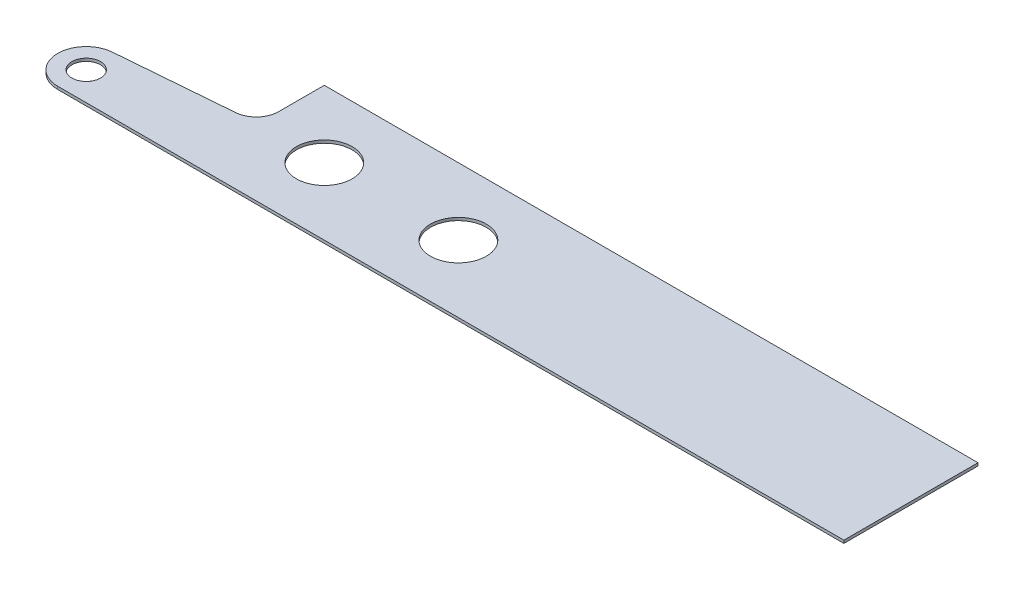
ISO-10303-21;
HEADER;
FILE_DESCRIPTION(('STEP AP214'),'2;1');
FILE_NAME('part.step','',(''),(''),'','','');
FILE_SCHEMA(('AUTOMOTIVE_DESIGN { 1 0 10303 214 1 1 1 1 }'));
ENDSEC;
DATA;
#1=APPLICATION_CONTEXT('core data for automotive mechanical design processes');
#2=APPLICATION_PROTOCOL_DEFINITION('international standard','automotive_design',2000,#1);
#3=PRODUCT_CONTEXT('',#1,'mechanical');
#4=PRODUCT('Part','Part','',(#3));
#5=PRODUCT_RELATED_PRODUCT_CATEGORY('part','',(#4));
#6=PRODUCT_DEFINITION_FORMATION('','',#4);
#7=PRODUCT_DEFINITION_CONTEXT('part definition',#1,'design');
#8=PRODUCT_DEFINITION('design','',#6,#7);
#9=PRODUCT_DEFINITION_SHAPE('','',#8);
#10=(LENGTH_UNIT() NAMED_UNIT(*) SI_UNIT(.MILLI.,.METRE.));
#11=(NAMED_UNIT(*) PLANE_ANGLE_UNIT() SI_UNIT($,.RADIAN.));
#12=(NAMED_UNIT(*) SI_UNIT($,.STERADIAN.) SOLID_ANGLE_UNIT());
#13=UNCERTAINTY_MEASURE_WITH_UNIT(LENGTH_MEASURE(1.E-05),#10,'distance_accuracy_value','');
#14=(GEOMETRIC_REPRESENTATION_CONTEXT(3) GLOBAL_UNCERTAINTY_ASSIGNED_CONTEXT((#13)) GLOBAL_UNIT_ASSIGNED_CONTEXT((#10,
#11,#12)) REPRESENTATION_CONTEXT('',''));
#15=CARTESIAN_POINT('',(0.,0.,0.));
#16=DIRECTION('',(0.,0.,1.));
#17=DIRECTION('',(1.,0.,0.));
#18=AXIS2_PLACEMENT_3D('',#15,#16,#17);
#19=CARTESIAN_POINT('',(0.,0.,0.));
#20=DIRECTION('',(0.,-1.,0.));
#21=DIRECTION('',(0.,0.,-1.));
#22=AXIS2_PLACEMENT_3D('',#19,#20,#21);
#23=PLANE('',#22);
#24=CARTESIAN_POINT('',(4.7625,0.,0.));
#25=DIRECTION('',(0.,1.,0.));
#26=DIRECTION('',(0.,0.,-1.));
#27=AXIS2_PLACEMENT_3D('',#24,#25,#26);
#28=CIRCLE('',#27,1.9812);
#29=CARTESIAN_POINT('',(4.7625,0.,-1.9812));
#30=VERTEX_POINT('',#29);
#31=EDGE_CURVE('E191',#30,#30,#28,.T.);
#32=ORIENTED_EDGE('',*,*,#31,.T.);
#33=EDGE_LOOP('',(#32));
#34=FACE_BOUND('',#33,.T.);
#35=DIRECTION('',(-1.,0.,0.));
#36=VECTOR('',#35,1.);
#37=CARTESIAN_POINT('',(-9.525,0.,-4.7625));
#38=LINE('',#37,#36);
#39=CARTESIAN_POINT('',(36.9062,0.,-4.7625));
#40=VERTEX_POINT('',#39);
#41=CARTESIAN_POINT('',(-9.525,0.,-4.7625));
#42=VERTEX_POINT('',#41);
#43=EDGE_CURVE('E207',#40,#42,#38,.T.);
#44=ORIENTED_EDGE('',*,*,#43,.F.);
#45=DIRECTION('',(0.,0.,-1.));
#46=VECTOR('',#45,1.);
#47=CARTESIAN_POINT('',(36.9062,0.,-4.7625));
#48=LINE('',#47,#46);
#49=CARTESIAN_POINT('',(36.9062,0.,4.7625));
#50=VERTEX_POINT('',#49);
#51=EDGE_CURVE('E152',#50,#40,#48,.T.);
#52=ORIENTED_EDGE('',*,*,#51,.F.);
#53=DIRECTION('',(1.,0.,0.));
#54=VECTOR('',#53,1.);
#55=CARTESIAN_POINT('',(-9.525,0.,4.7625));
#56=LINE('',#55,#54);
#57=CARTESIAN_POINT('',(-18.9323658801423,0.,4.7625));
#58=VERTEX_POINT('',#57);
#59=EDGE_CURVE('E213',#58,#50,#56,.T.);
#60=ORIENTED_EDGE('',*,*,#59,.F.);
#61=CARTESIAN_POINT('',(-18.9323658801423,0.,2.73986588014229));
#62=DIRECTION('',(0.,1.,0.));
#63=DIRECTION('',(0.,0.,-1.));
#64=AXIS2_PLACEMENT_3D('',#61,#62,#63);
#65=CIRCLE('',#64,2.02263411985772);
#66=CARTESIAN_POINT('',(-19.0964705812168,0.,0.723900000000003));
#67=VERTEX_POINT('',#66);
#68=EDGE_CURVE('E177',#67,#58,#65,.T.);
#69=ORIENTED_EDGE('',*,*,#68,.F.);
#70=DIRECTION('',(-0.996703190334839,0.,0.0811341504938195));
#71=VECTOR('',#70,1.);
#72=CARTESIAN_POINT('',(-19.0964705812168,0.,0.723900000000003));
#73=LINE('',#72,#71);
#74=CARTESIAN_POINT('',(-10.9836995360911,0.,0.0635000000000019));
#75=VERTEX_POINT('',#74);
#76=EDGE_CURVE('E173',#75,#67,#73,.T.);
#77=ORIENTED_EDGE('',*,*,#76,.F.);
#78=CARTESIAN_POINT('',(-11.1125,0.,-1.51876631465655));
#79=DIRECTION('',(0.,-1.,0.));
#80=DIRECTION('',(0.,0.,1.));
#81=AXIS2_PLACEMENT_3D('',#78,#79,#80);
#82=CIRCLE('',#81,1.5875);
#83=CARTESIAN_POINT('',(-9.525,0.,-1.51876631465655));
#84=VERTEX_POINT('',#83);
#85=EDGE_CURVE('E170',#84,#75,#82,.T.);
#86=ORIENTED_EDGE('',*,*,#85,.F.);
#87=DIRECTION('',(0.,0.,1.));
#88=VECTOR('',#87,1.);
#89=CARTESIAN_POINT('',(-9.525,0.,4.7625));
#90=LINE('',#89,#88);
#91=EDGE_CURVE('E220',#42,#84,#90,.T.);
#92=ORIENTED_EDGE('',*,*,#91,.F.);
#93=EDGE_LOOP('',(#44,#52,#60,#69,#77,#86,#92));
#94=FACE_BOUND('',#93,.T.);
#95=CARTESIAN_POINT('',(-4.7625,0.,0.));
#96=DIRECTION('',(0.,1.,0.));
#97=DIRECTION('',(0.,0.,1.));
#98=AXIS2_PLACEMENT_3D('',#95,#96,#97);
#99=CIRCLE('',#98,1.9812);
#100=CARTESIAN_POINT('',(-4.7625,0.,1.9812));
#101=VERTEX_POINT('',#100);
#102=EDGE_CURVE('E201',#101,#101,#99,.T.);
#103=ORIENTED_EDGE('',*,*,#102,.T.);
#104=EDGE_LOOP('',(#103));
#105=FACE_BOUND('',#104,.T.);
#106=CARTESIAN_POINT('',(-18.9323658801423,0.,2.73986588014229));
#107=DIRECTION('',(0.,1.,0.));
#108=DIRECTION('',(0.,0.,1.));
#109=AXIS2_PLACEMENT_3D('',#106,#107,#108);
#110=CIRCLE('',#109,1.016);
#111=CARTESIAN_POINT('',(-18.9323658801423,0.,3.75586588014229));
#112=VERTEX_POINT('',#111);
#113=EDGE_CURVE('E164',#112,#112,#110,.T.);
#114=ORIENTED_EDGE('',*,*,#113,.T.);
#115=EDGE_LOOP('',(#114));
#116=FACE_BOUND('',#115,.T.);
#117=DIRECTION('',(-0.707106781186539,0.,0.707106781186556));
#118=VECTOR('',#117,1.);
#119=CARTESIAN_POINT('',(33.7773323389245,0.,-1.14947278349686));
#120=LINE('',#119,#118);
#121=CARTESIAN_POINT('',(33.7773323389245,0.,-1.14947278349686));
#122=VERTEX_POINT('',#121);
#123=CARTESIAN_POINT('',(33.5977272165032,0.,-0.969867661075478));
#124=VERTEX_POINT('',#123);
#125=EDGE_CURVE('E138',#122,#124,#120,.T.);
#126=ORIENTED_EDGE('',*,*,#125,.T.);
#127=DIRECTION('',(-0.707106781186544,0.,-0.707106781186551));
#128=VECTOR('',#127,1.);
#129=CARTESIAN_POINT('',(35.7170676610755,0.,1.14947278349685));
#130=LINE('',#129,#128);
#131=CARTESIAN_POINT('',(35.7170676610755,0.,1.14947278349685));
#132=VERTEX_POINT('',#131);
#133=EDGE_CURVE('E125',#132,#124,#130,.T.);
#134=ORIENTED_EDGE('',*,*,#133,.F.);
#135=DIRECTION('',(0.707106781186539,0.,-0.707106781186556));
#136=VECTOR('',#135,1.);
#137=CARTESIAN_POINT('',(35.7170676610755,0.,1.14947278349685));
#138=LINE('',#137,#136);
#139=CARTESIAN_POINT('',(35.8966727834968,0.,0.969867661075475));
#140=VERTEX_POINT('',#139);
#141=EDGE_CURVE('E130',#132,#140,#138,.T.);
#142=ORIENTED_EDGE('',*,*,#141,.T.);
#143=DIRECTION('',(-0.707106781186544,0.,-0.707106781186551));
#144=VECTOR('',#143,1.);
#145=CARTESIAN_POINT('',(35.8966727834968,0.,0.969867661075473));
#146=LINE('',#145,#144);
#147=EDGE_CURVE('E141',#140,#122,#146,.T.);
#148=ORIENTED_EDGE('',*,*,#147,.T.);
#149=EDGE_LOOP('',(#126,#134,#142,#148));
#150=FACE_BOUND('',#149,.T.);
#151=ADVANCED_FACE('F35',(#34,#94,#105,#116,#150),#23,.T.);
#152=CARTESIAN_POINT('',(-9.525,0.2032,4.7625));
#153=DIRECTION('',(1.,0.,0.));
#154=DIRECTION('',(0.,0.,-1.));
#155=AXIS2_PLACEMENT_3D('',#152,#153,#154);
#156=PLANE('',#155);
#157=DIRECTION('',(0.,1.,0.));
#158=VECTOR('',#157,1.);
#159=CARTESIAN_POINT('',(-9.525,0.,-1.51876631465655));
#160=LINE('',#159,#158);
#161=CARTESIAN_POINT('',(-9.525,0.2032,-1.51876631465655));
#162=VERTEX_POINT('',#161);
#163=EDGE_CURVE('E180',#84,#162,#160,.T.);
#164=ORIENTED_EDGE('',*,*,#163,.T.);
#165=DIRECTION('',(0.,0.,1.));
#166=VECTOR('',#165,1.);
#167=CARTESIAN_POINT('',(-9.525,0.2032,4.7625));
#168=LINE('',#167,#166);
#169=CARTESIAN_POINT('',(-9.525,0.2032,-4.7625));
#170=VERTEX_POINT('',#169);
#171=EDGE_CURVE('E212',#170,#162,#168,.T.);
#172=ORIENTED_EDGE('',*,*,#171,.F.);
#173=DIRECTION('',(0.,-1.,0.));
#174=VECTOR('',#173,1.);
#175=CARTESIAN_POINT('',(-9.525,0.2032,-4.7625));
#176=LINE('',#175,#174);
#177=EDGE_CURVE('E218',#170,#42,#176,.T.);
#178=ORIENTED_EDGE('',*,*,#177,.T.);
#179=ORIENTED_EDGE('',*,*,#91,.T.);
#180=EDGE_LOOP('',(#164,#172,#178,#179));
#181=FACE_BOUND('',#180,.T.);
#182=ADVANCED_FACE('F254',(#181),#156,.F.);
#183=CARTESIAN_POINT('',(0.,0.2032,0.));
#184=DIRECTION('',(0.,-1.,0.));
#185=DIRECTION('',(0.,0.,-1.));
#186=AXIS2_PLACEMENT_3D('',#183,#184,#185);
#187=PLANE('',#186);
#188=CARTESIAN_POINT('',(-18.9323658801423,0.2032,2.73986588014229));
#189=DIRECTION('',(0.,1.,0.));
#190=DIRECTION('',(0.,0.,1.));
#191=AXIS2_PLACEMENT_3D('',#188,#189,#190);
#192=CIRCLE('',#191,1.016);
#193=CARTESIAN_POINT('',(-18.9323658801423,0.2032,3.75586588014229));
#194=VERTEX_POINT('',#193);
#195=EDGE_CURVE('E161',#194,#194,#192,.T.);
#196=ORIENTED_EDGE('',*,*,#195,.F.);
#197=EDGE_LOOP('',(#196));
#198=FACE_BOUND('',#197,.T.);
#199=CARTESIAN_POINT('',(-4.7625,0.2032,0.));
#200=DIRECTION('',(0.,1.,0.));
#201=DIRECTION('',(0.,0.,1.));
#202=AXIS2_PLACEMENT_3D('',#199,#200,#201);
#203=CIRCLE('',#202,1.9812);
#204=CARTESIAN_POINT('',(-4.7625,0.2032,1.9812));
#205=VERTEX_POINT('',#204);
#206=EDGE_CURVE('E204',#205,#205,#203,.T.);
#207=ORIENTED_EDGE('',*,*,#206,.F.);
#208=EDGE_LOOP('',(#207));
#209=FACE_BOUND('',#208,.T.);
#210=DIRECTION('',(1.,0.,0.));
#211=VECTOR('',#210,1.);
#212=CARTESIAN_POINT('',(-9.525,0.2032,4.7625));
#213=LINE('',#212,#211);
#214=CARTESIAN_POINT('',(-18.9323658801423,0.2032,4.7625));
#215=VERTEX_POINT('',#214);
#216=CARTESIAN_POINT('',(36.9062,0.2032,4.7625));
#217=VERTEX_POINT('',#216);
#218=EDGE_CURVE('E216',#215,#217,#213,.T.);
#219=ORIENTED_EDGE('',*,*,#218,.T.);
#220=DIRECTION('',(0.,0.,-1.));
#221=VECTOR('',#220,1.);
#222=CARTESIAN_POINT('',(36.9062,0.2032,-4.7625));
#223=LINE('',#222,#221);
#224=CARTESIAN_POINT('',(36.9062,0.2032,-4.7625));
#225=VERTEX_POINT('',#224);
#226=EDGE_CURVE('E151',#217,#225,#223,.T.);
#227=ORIENTED_EDGE('',*,*,#226,.T.);
#228=DIRECTION('',(-1.,0.,0.));
#229=VECTOR('',#228,1.);
#230=CARTESIAN_POINT('',(-9.525,0.2032,-4.7625));
#231=LINE('',#230,#229);
#232=EDGE_CURVE('E210',#225,#170,#231,.T.);
#233=ORIENTED_EDGE('',*,*,#232,.T.);
#234=ORIENTED_EDGE('',*,*,#171,.T.);
#235=CARTESIAN_POINT('',(-11.1125,0.2032,-1.51876631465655));
#236=DIRECTION('',(0.,-1.,0.));
#237=DIRECTION('',(0.,0.,1.));
#238=AXIS2_PLACEMENT_3D('',#235,#236,#237);
#239=CIRCLE('',#238,1.5875);
#240=CARTESIAN_POINT('',(-10.9836995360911,0.2032,0.0635000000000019));
#241=VERTEX_POINT('',#240);
#242=EDGE_CURVE('E167',#162,#241,#239,.T.);
#243=ORIENTED_EDGE('',*,*,#242,.T.);
#244=DIRECTION('',(-0.996703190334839,0.,0.0811341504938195));
#245=VECTOR('',#244,1.);
#246=CARTESIAN_POINT('',(-19.0964705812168,0.2032,0.723900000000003));
#247=LINE('',#246,#245);
#248=CARTESIAN_POINT('',(-19.0964705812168,0.2032,0.723900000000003));
#249=VERTEX_POINT('',#248);
#250=EDGE_CURVE('E183',#241,#249,#247,.T.);
#251=ORIENTED_EDGE('',*,*,#250,.T.);
#252=CARTESIAN_POINT('',(-18.9323658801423,0.2032,2.73986588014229));
#253=DIRECTION('',(0.,1.,0.));
#254=DIRECTION('',(0.,0.,-1.));
#255=AXIS2_PLACEMENT_3D('',#252,#253,#254);
#256=CIRCLE('',#255,2.02263411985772);
#257=EDGE_CURVE('E174',#249,#215,#256,.T.);
#258=ORIENTED_EDGE('',*,*,#257,.T.);
#259=EDGE_LOOP('',(#219,#227,#233,#234,#243,#251,#258));
#260=FACE_BOUND('',#259,.T.);
#261=CARTESIAN_POINT('',(4.7625,0.2032,0.));
#262=DIRECTION('',(0.,1.,0.));
#263=DIRECTION('',(0.,0.,-1.));
#264=AXIS2_PLACEMENT_3D('',#261,#262,#263);
#265=CIRCLE('',#264,1.9812);
#266=CARTESIAN_POINT('',(4.7625,0.2032,-1.9812));
#267=VERTEX_POINT('',#266);
#268=EDGE_CURVE('E198',#267,#267,#265,.T.);
#269=ORIENTED_EDGE('',*,*,#268,.F.);
#270=EDGE_LOOP('',(#269));
#271=FACE_BOUND('',#270,.T.);
#272=ADVANCED_FACE('F260',(#198,#209,#260,#271),#187,.F.);
#273=CARTESIAN_POINT('',(-9.525,0.2032,-4.7625));
#274=DIRECTION('',(0.,0.,1.));
#275=DIRECTION('',(1.,0.,0.));
#276=AXIS2_PLACEMENT_3D('',#273,#274,#275);
#277=PLANE('',#276);
#278=ORIENTED_EDGE('',*,*,#43,.T.);
#279=ORIENTED_EDGE('',*,*,#177,.F.);
#280=ORIENTED_EDGE('',*,*,#232,.F.);
#281=DIRECTION('',(0.,1.,0.));
#282=VECTOR('',#281,1.);
#283=CARTESIAN_POINT('',(36.9062,0.,-4.7625));
#284=LINE('',#283,#282);
#285=EDGE_CURVE('E158',#40,#225,#284,.T.);
#286=ORIENTED_EDGE('',*,*,#285,.F.);
#287=EDGE_LOOP('',(#278,#279,#280,#286));
#288=FACE_BOUND('',#287,.T.);
#289=ADVANCED_FACE('F270',(#288),#277,.F.);
#290=CARTESIAN_POINT('',(-9.525,0.2032,4.7625));
#291=DIRECTION('',(0.,0.,-1.));
#292=DIRECTION('',(-1.,0.,0.));
#293=AXIS2_PLACEMENT_3D('',#290,#291,#292);
#294=PLANE('',#293);
#295=ORIENTED_EDGE('',*,*,#59,.T.);
#296=DIRECTION('',(0.,1.,0.));
#297=VECTOR('',#296,1.);
#298=CARTESIAN_POINT('',(36.9062,0.,4.7625));
#299=LINE('',#298,#297);
#300=EDGE_CURVE('E155',#50,#217,#299,.T.);
#301=ORIENTED_EDGE('',*,*,#300,.T.);
#302=ORIENTED_EDGE('',*,*,#218,.F.);
#303=DIRECTION('',(0.,1.,0.));
#304=VECTOR('',#303,1.);
#305=CARTESIAN_POINT('',(-18.9323658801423,0.,4.7625));
#306=LINE('',#305,#304);
#307=EDGE_CURVE('E188',#58,#215,#306,.T.);
#308=ORIENTED_EDGE('',*,*,#307,.F.);
#309=EDGE_LOOP('',(#295,#301,#302,#308));
#310=FACE_BOUND('',#309,.T.);
#311=ADVANCED_FACE('F267',(#310),#294,.F.);
#312=CARTESIAN_POINT('',(-4.7625,0.2032,0.));
#313=DIRECTION('',(0.,-1.,0.));
#314=DIRECTION('',(0.,0.,-1.));
#315=AXIS2_PLACEMENT_3D('',#312,#313,#314);
#316=CYLINDRICAL_SURFACE('',#315,1.9812);
#317=ORIENTED_EDGE('',*,*,#206,.T.);
#318=EDGE_LOOP('',(#317));
#319=FACE_BOUND('',#318,.T.);
#320=ORIENTED_EDGE('',*,*,#102,.F.);
#321=EDGE_LOOP('',(#320));
#322=FACE_BOUND('',#321,.T.);
#323=ADVANCED_FACE('F269',(#319,#322),#316,.F.);
#324=CARTESIAN_POINT('',(4.7625,0.2032,0.));
#325=DIRECTION('',(0.,-1.,0.));
#326=DIRECTION('',(0.,0.,-1.));
#327=AXIS2_PLACEMENT_3D('',#324,#325,#326);
#328=CYLINDRICAL_SURFACE('',#327,1.9812);
#329=ORIENTED_EDGE('',*,*,#268,.T.);
#330=EDGE_LOOP('',(#329));
#331=FACE_BOUND('',#330,.T.);
#332=ORIENTED_EDGE('',*,*,#31,.F.);
#333=EDGE_LOOP('',(#332));
#334=FACE_BOUND('',#333,.T.);
#335=ADVANCED_FACE('F383',(#331,#334),#328,.F.);
#336=CARTESIAN_POINT('',(-18.9323658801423,0.,2.73986588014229));
#337=DIRECTION('',(0.,1.,0.));
#338=DIRECTION('',(0.,0.,1.));
#339=AXIS2_PLACEMENT_3D('',#336,#337,#338);
#340=CYLINDRICAL_SURFACE('',#339,2.02263411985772);
#341=ORIENTED_EDGE('',*,*,#257,.F.);
#342=DIRECTION('',(0.,1.,0.));
#343=VECTOR('',#342,1.);
#344=CARTESIAN_POINT('',(-19.0964705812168,0.,0.723900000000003));
#345=LINE('',#344,#343);
#346=EDGE_CURVE('E192',#67,#249,#345,.T.);
#347=ORIENTED_EDGE('',*,*,#346,.F.);
#348=ORIENTED_EDGE('',*,*,#68,.T.);
#349=ORIENTED_EDGE('',*,*,#307,.T.);
#350=EDGE_LOOP('',(#341,#347,#348,#349));
#351=FACE_BOUND('',#350,.T.);
#352=ADVANCED_FACE('F373',(#351),#340,.T.);
#353=CARTESIAN_POINT('',(-19.0964705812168,0.,0.723900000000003));
#354=DIRECTION('',(-0.0811341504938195,0.,-0.996703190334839));
#355=DIRECTION('',(-0.996703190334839,0.,0.0811341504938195));
#356=AXIS2_PLACEMENT_3D('',#353,#354,#355);
#357=PLANE('',#356);
#358=ORIENTED_EDGE('',*,*,#250,.F.);
#359=DIRECTION('',(0.,1.,0.));
#360=VECTOR('',#359,1.);
#361=CARTESIAN_POINT('',(-10.9836995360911,0.,0.0635000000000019));
#362=LINE('',#361,#360);
#363=EDGE_CURVE('E194',#75,#241,#362,.T.);
#364=ORIENTED_EDGE('',*,*,#363,.F.);
#365=ORIENTED_EDGE('',*,*,#76,.T.);
#366=ORIENTED_EDGE('',*,*,#346,.T.);
#367=EDGE_LOOP('',(#358,#364,#365,#366));
#368=FACE_BOUND('',#367,.T.);
#369=ADVANCED_FACE('F363',(#368),#357,.T.);
#370=CARTESIAN_POINT('',(-11.1125,0.,-1.51876631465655));
#371=DIRECTION('',(0.,1.,0.));
#372=DIRECTION('',(0.,0.,1.));
#373=AXIS2_PLACEMENT_3D('',#370,#371,#372);
#374=CYLINDRICAL_SURFACE('',#373,1.5875);
#375=ORIENTED_EDGE('',*,*,#242,.F.);
#376=ORIENTED_EDGE('',*,*,#163,.F.);
#377=ORIENTED_EDGE('',*,*,#85,.T.);
#378=ORIENTED_EDGE('',*,*,#363,.T.);
#379=EDGE_LOOP('',(#375,#376,#377,#378));
#380=FACE_BOUND('',#379,.T.);
#381=ADVANCED_FACE('F353',(#380),#374,.F.);
#382=CARTESIAN_POINT('',(-18.9323658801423,0.,2.73986588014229));
#383=DIRECTION('',(0.,1.,0.));
#384=DIRECTION('',(0.,0.,1.));
#385=AXIS2_PLACEMENT_3D('',#382,#383,#384);
#386=CYLINDRICAL_SURFACE('',#385,1.016);
#387=ORIENTED_EDGE('',*,*,#113,.F.);
#388=EDGE_LOOP('',(#387));
#389=FACE_BOUND('',#388,.T.);
#390=ORIENTED_EDGE('',*,*,#195,.T.);
#391=EDGE_LOOP('',(#390));
#392=FACE_BOUND('',#391,.T.);
#393=ADVANCED_FACE('F318',(#389,#392),#386,.F.);
#394=CARTESIAN_POINT('',(36.9062,0.,-4.7625));
#395=DIRECTION('',(1.,0.,0.));
#396=DIRECTION('',(0.,0.,-1.));
#397=AXIS2_PLACEMENT_3D('',#394,#395,#396);
#398=PLANE('',#397);
#399=ORIENTED_EDGE('',*,*,#226,.F.);
#400=ORIENTED_EDGE('',*,*,#300,.F.);
#401=ORIENTED_EDGE('',*,*,#51,.T.);
#402=ORIENTED_EDGE('',*,*,#285,.T.);
#403=EDGE_LOOP('',(#399,#400,#401,#402));
#404=FACE_BOUND('',#403,.T.);
#405=ADVANCED_FACE('F303',(#404),#398,.T.);
#406=CARTESIAN_POINT('',(35.7170676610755,-0.254,1.14947278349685));
#407=DIRECTION('',(0.707106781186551,0.,-0.707106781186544));
#408=DIRECTION('',(-0.707106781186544,0.,-0.707106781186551));
#409=AXIS2_PLACEMENT_3D('',#406,#407,#408);
#410=PLANE('',#409);
#411=DIRECTION('',(0.,1.,0.));
#412=VECTOR('',#411,1.);
#413=CARTESIAN_POINT('',(33.5977272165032,-0.254,-0.969867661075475));
#414=LINE('',#413,#412);
#415=CARTESIAN_POINT('',(33.5977272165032,-0.127,-0.969867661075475));
#416=VERTEX_POINT('',#415);
#417=EDGE_CURVE('E149',#416,#124,#414,.T.);
#418=ORIENTED_EDGE('',*,*,#417,.F.);
#419=DIRECTION('',(-0.707106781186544,0.,-0.707106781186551));
#420=VECTOR('',#419,1.);
#421=CARTESIAN_POINT('',(35.7170676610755,-0.127,1.14947278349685));
#422=LINE('',#421,#420);
#423=CARTESIAN_POINT('',(35.7170676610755,-0.127,1.14947278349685));
#424=VERTEX_POINT('',#423);
#425=EDGE_CURVE('E127',#416,#424,#422,.F.);
#426=ORIENTED_EDGE('',*,*,#425,.T.);
#427=DIRECTION('',(0.,1.,0.));
#428=VECTOR('',#427,1.);
#429=CARTESIAN_POINT('',(35.7170676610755,-0.254,1.14947278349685));
#430=LINE('',#429,#428);
#431=EDGE_CURVE('E121',#424,#132,#430,.T.);
#432=ORIENTED_EDGE('',*,*,#431,.T.);
#433=ORIENTED_EDGE('',*,*,#133,.T.);
#434=EDGE_LOOP('',(#418,#426,#432,#433));
#435=FACE_BOUND('',#434,.T.);
#436=ADVANCED_FACE('F124',(#435),#410,.F.);
#437=CARTESIAN_POINT('',(33.7773323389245,-0.254,-1.14947278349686));
#438=DIRECTION('',(-0.707106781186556,0.,-0.707106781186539));
#439=DIRECTION('',(-0.707106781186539,0.,0.707106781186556));
#440=AXIS2_PLACEMENT_3D('',#437,#438,#439);
#441=PLANE('',#440);
#442=CARTESIAN_POINT('',(33.6875297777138,-0.127,-1.05967022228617));
#443=DIRECTION('',(-0.707106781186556,0.,-0.707106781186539));
#444=DIRECTION('',(-0.707106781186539,0.,0.707106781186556));
#445=AXIS2_PLACEMENT_3D('',#442,#443,#444);
#446=CIRCLE('',#445,0.127);
#447=CARTESIAN_POINT('',(33.7773323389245,-0.127,-1.14947278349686));
#448=VERTEX_POINT('',#447);
#449=CARTESIAN_POINT('',(33.6875297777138,-0.254,-1.05967022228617));
#450=VERTEX_POINT('',#449);
#451=EDGE_CURVE('E226',#448,#450,#446,.T.);
#452=ORIENTED_EDGE('',*,*,#451,.T.);
#453=CARTESIAN_POINT('',(33.6875297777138,-0.127,-1.05967022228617));
#454=DIRECTION('',(-0.707106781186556,0.,-0.707106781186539));
#455=DIRECTION('',(-0.707106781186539,0.,0.707106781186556));
#456=AXIS2_PLACEMENT_3D('',#453,#454,#455);
#457=CIRCLE('',#456,0.127);
#458=EDGE_CURVE('E228',#450,#416,#457,.T.);
#459=ORIENTED_EDGE('',*,*,#458,.T.);
#460=ORIENTED_EDGE('',*,*,#417,.T.);
#461=ORIENTED_EDGE('',*,*,#125,.F.);
#462=DIRECTION('',(0.,1.,0.));
#463=VECTOR('',#462,1.);
#464=CARTESIAN_POINT('',(33.7773323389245,-0.254,-1.14947278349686));
#465=LINE('',#464,#463);
#466=EDGE_CURVE('E147',#448,#122,#465,.T.);
#467=ORIENTED_EDGE('',*,*,#466,.F.);
#468=EDGE_LOOP('',(#452,#459,#460,#461,#467));
#469=FACE_BOUND('',#468,.T.);
#470=ADVANCED_FACE('F234',(#469),#441,.T.);
#471=CARTESIAN_POINT('',(35.8966727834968,-0.254,0.969867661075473));
#472=DIRECTION('',(0.707106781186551,0.,-0.707106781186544));
#473=DIRECTION('',(-0.707106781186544,0.,-0.707106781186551));
#474=AXIS2_PLACEMENT_3D('',#471,#472,#473);
#475=PLANE('',#474);
#476=DIRECTION('',(0.,1.,0.));
#477=VECTOR('',#476,1.);
#478=CARTESIAN_POINT('',(35.8966727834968,-0.254,0.969867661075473));
#479=LINE('',#478,#477);
#480=CARTESIAN_POINT('',(35.8966727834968,-0.127,0.969867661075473));
#481=VERTEX_POINT('',#480);
#482=EDGE_CURVE('E129',#481,#140,#479,.T.);
#483=ORIENTED_EDGE('',*,*,#482,.F.);
#484=DIRECTION('',(-0.707106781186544,0.,-0.707106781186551));
#485=VECTOR('',#484,1.);
#486=CARTESIAN_POINT('',(33.7773323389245,-0.127,-1.14947278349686));
#487=LINE('',#486,#485);
#488=EDGE_CURVE('E11',#481,#448,#487,.T.);
#489=ORIENTED_EDGE('',*,*,#488,.T.);
#490=ORIENTED_EDGE('',*,*,#466,.T.);
#491=ORIENTED_EDGE('',*,*,#147,.F.);
#492=EDGE_LOOP('',(#483,#489,#490,#491));
#493=FACE_BOUND('',#492,.T.);
#494=ADVANCED_FACE('F244',(#493),#475,.T.);
#495=CARTESIAN_POINT('',(35.7170676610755,-0.254,1.14947278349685));
#496=DIRECTION('',(0.707106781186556,0.,0.707106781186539));
#497=DIRECTION('',(0.707106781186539,0.,-0.707106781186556));
#498=AXIS2_PLACEMENT_3D('',#495,#496,#497);
#499=PLANE('',#498);
#500=ORIENTED_EDGE('',*,*,#431,.F.);
#501=CARTESIAN_POINT('',(35.8068702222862,-0.127,1.05967022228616));
#502=DIRECTION('',(0.707106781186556,0.,0.707106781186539));
#503=DIRECTION('',(0.707106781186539,0.,-0.707106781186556));
#504=AXIS2_PLACEMENT_3D('',#501,#502,#503);
#505=CIRCLE('',#504,0.127);
#506=CARTESIAN_POINT('',(35.8068702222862,-0.254,1.05967022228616));
#507=VERTEX_POINT('',#506);
#508=EDGE_CURVE('E44',#424,#507,#505,.T.);
#509=ORIENTED_EDGE('',*,*,#508,.T.);
#510=CARTESIAN_POINT('',(35.8068702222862,-0.127,1.05967022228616));
#511=DIRECTION('',(0.707106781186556,0.,0.707106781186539));
#512=DIRECTION('',(0.707106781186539,0.,-0.707106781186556));
#513=AXIS2_PLACEMENT_3D('',#510,#511,#512);
#514=CIRCLE('',#513,0.127);
#515=EDGE_CURVE('E51',#507,#481,#514,.T.);
#516=ORIENTED_EDGE('',*,*,#515,.T.);
#517=ORIENTED_EDGE('',*,*,#482,.T.);
#518=ORIENTED_EDGE('',*,*,#141,.F.);
#519=EDGE_LOOP('',(#500,#509,#516,#517,#518));
#520=FACE_BOUND('',#519,.T.);
#521=ADVANCED_FACE('F140',(#520),#499,.T.);
#522=CARTESIAN_POINT('',(35.8068702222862,-0.127,1.05967022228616));
#523=DIRECTION('',(0.707106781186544,0.,0.707106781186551));
#524=DIRECTION('',(0.707106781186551,0.,-0.707106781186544));
#525=AXIS2_PLACEMENT_3D('',#522,#523,#524);
#526=CYLINDRICAL_SURFACE('',#525,0.127);
#527=ORIENTED_EDGE('',*,*,#488,.F.);
#528=ORIENTED_EDGE('',*,*,#515,.F.);
#529=DIRECTION('',(-0.707106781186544,0.,-0.707106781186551));
#530=VECTOR('',#529,1.);
#531=CARTESIAN_POINT('',(35.8068702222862,-0.254,1.05967022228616));
#532=LINE('',#531,#530);
#533=EDGE_CURVE('E39',#450,#507,#532,.F.);
#534=ORIENTED_EDGE('',*,*,#533,.F.);
#535=ORIENTED_EDGE('',*,*,#451,.F.);
#536=EDGE_LOOP('',(#527,#528,#534,#535));
#537=FACE_BOUND('',#536,.T.);
#538=ADVANCED_FACE('F37',(#537),#526,.T.);
#539=CARTESIAN_POINT('',(17.3736000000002,-0.127,-17.3736));
#540=DIRECTION('',(-0.707106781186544,0.,-0.707106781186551));
#541=DIRECTION('',(-0.707106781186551,0.,0.707106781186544));
#542=AXIS2_PLACEMENT_3D('',#539,#540,#541);
#543=CYLINDRICAL_SURFACE('',#542,0.127);
#544=ORIENTED_EDGE('',*,*,#508,.F.);
#545=ORIENTED_EDGE('',*,*,#425,.F.);
#546=ORIENTED_EDGE('',*,*,#458,.F.);
#547=ORIENTED_EDGE('',*,*,#533,.T.);
#548=EDGE_LOOP('',(#544,#545,#546,#547));
#549=FACE_BOUND('',#548,.T.);
#550=ADVANCED_FACE('F240',(#549),#543,.T.);
#551=CLOSED_SHELL('',(#151,#182,#272,#289,#311,#323,#335,#352,#369,#381,#393,#405,#436,#470,
#494,#521,#538,#550));
#552=MANIFOLD_SOLID_BREP('B2',#551);
#553=ADVANCED_BREP_SHAPE_REPRESENTATION('',(#18,#552),#14);
#554=SHAPE_DEFINITION_REPRESENTATION(#9,#553);
ENDSEC;
END-ISO-10303-21;
